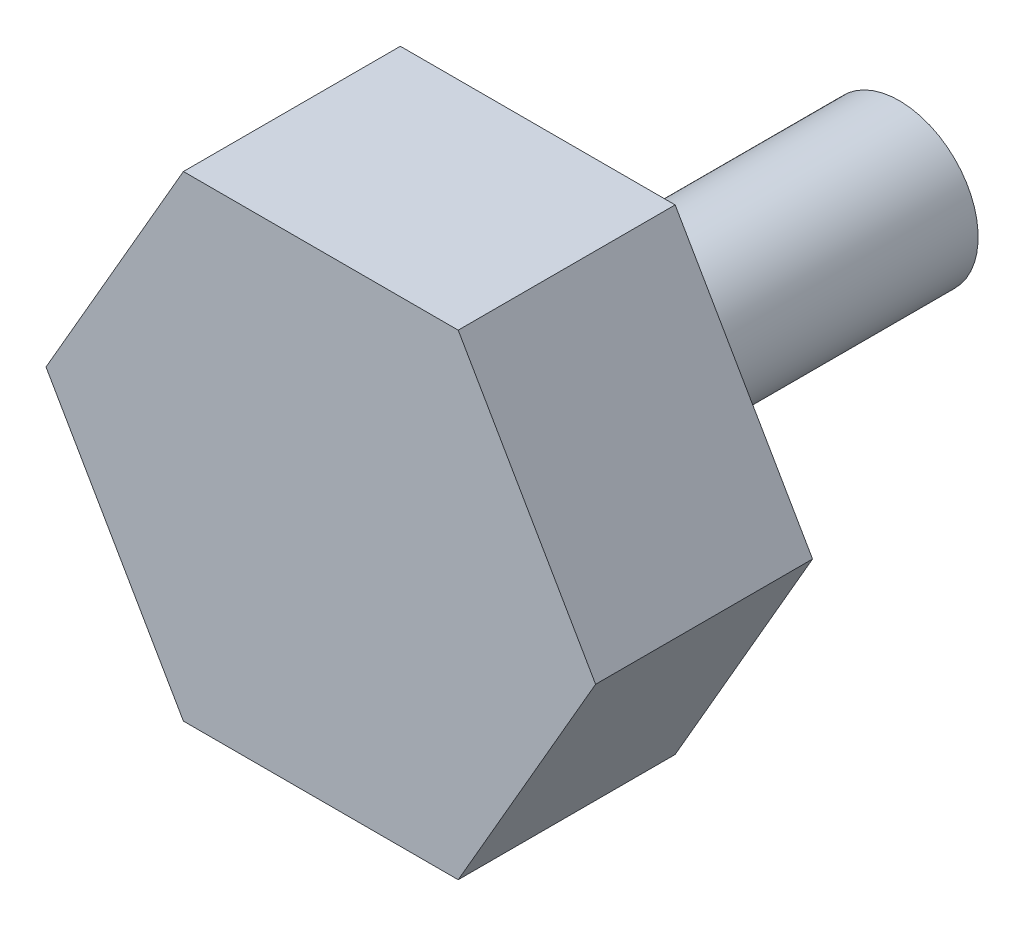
ISO-10303-21;
HEADER;
FILE_DESCRIPTION(('STEP AP214'),'2;1');
FILE_NAME('part.step','',(''),(''),'','','');
FILE_SCHEMA(('AUTOMOTIVE_DESIGN { 1 0 10303 214 1 1 1 1 }'));
ENDSEC;
DATA;
#1=APPLICATION_CONTEXT('core data for automotive mechanical design processes');
#2=APPLICATION_PROTOCOL_DEFINITION('international standard','automotive_design',2000,#1);
#3=PRODUCT_CONTEXT('',#1,'mechanical');
#4=PRODUCT('Part','Part','',(#3));
#5=PRODUCT_RELATED_PRODUCT_CATEGORY('part','',(#4));
#6=PRODUCT_DEFINITION_FORMATION('','',#4);
#7=PRODUCT_DEFINITION_CONTEXT('part definition',#1,'design');
#8=PRODUCT_DEFINITION('design','',#6,#7);
#9=PRODUCT_DEFINITION_SHAPE('','',#8);
#10=(LENGTH_UNIT() NAMED_UNIT(*) SI_UNIT(.MILLI.,.METRE.));
#11=(NAMED_UNIT(*) PLANE_ANGLE_UNIT() SI_UNIT($,.RADIAN.));
#12=(NAMED_UNIT(*) SI_UNIT($,.STERADIAN.) SOLID_ANGLE_UNIT());
#13=UNCERTAINTY_MEASURE_WITH_UNIT(LENGTH_MEASURE(1.E-05),#10,'distance_accuracy_value','');
#14=(GEOMETRIC_REPRESENTATION_CONTEXT(3) GLOBAL_UNCERTAINTY_ASSIGNED_CONTEXT((#13)) GLOBAL_UNIT_ASSIGNED_CONTEXT((#10,
#11,#12)) REPRESENTATION_CONTEXT('',''));
#15=CARTESIAN_POINT('',(0.,0.,0.));
#16=DIRECTION('',(0.,0.,1.));
#17=DIRECTION('',(1.,0.,0.));
#18=AXIS2_PLACEMENT_3D('',#15,#16,#17);
#19=CARTESIAN_POINT('',(-1.9,-3.29089653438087,3.));
#20=DIRECTION('',(0.,1.,0.));
#21=DIRECTION('',(0.,0.,1.));
#22=AXIS2_PLACEMENT_3D('',#19,#20,#21);
#23=PLANE('',#22);
#24=DIRECTION('',(1.,0.,0.));
#25=VECTOR('',#24,1.);
#26=CARTESIAN_POINT('',(-1.9,-3.29089653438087,0.));
#27=LINE('',#26,#25);
#28=CARTESIAN_POINT('',(-1.9,-3.29089653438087,0.));
#29=VERTEX_POINT('',#28);
#30=CARTESIAN_POINT('',(1.9,-3.29089653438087,0.));
#31=VERTEX_POINT('',#30);
#32=EDGE_CURVE('E129',#29,#31,#27,.T.);
#33=ORIENTED_EDGE('',*,*,#32,.T.);
#34=DIRECTION('',(0.,0.,-1.));
#35=VECTOR('',#34,1.);
#36=CARTESIAN_POINT('',(1.9,-3.29089653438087,3.));
#37=LINE('',#36,#35);
#38=CARTESIAN_POINT('',(1.9,-3.29089653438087,3.));
#39=VERTEX_POINT('',#38);
#40=EDGE_CURVE('E46',#39,#31,#37,.T.);
#41=ORIENTED_EDGE('',*,*,#40,.F.);
#42=DIRECTION('',(1.,0.,0.));
#43=VECTOR('',#42,1.);
#44=CARTESIAN_POINT('',(-1.9,-3.29089653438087,3.));
#45=LINE('',#44,#43);
#46=CARTESIAN_POINT('',(-1.9,-3.29089653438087,3.));
#47=VERTEX_POINT('',#46);
#48=EDGE_CURVE('E140',#47,#39,#45,.T.);
#49=ORIENTED_EDGE('',*,*,#48,.F.);
#50=DIRECTION('',(0.,0.,-1.));
#51=VECTOR('',#50,1.);
#52=CARTESIAN_POINT('',(-1.9,-3.29089653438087,3.));
#53=LINE('',#52,#51);
#54=EDGE_CURVE('E125',#47,#29,#53,.T.);
#55=ORIENTED_EDGE('',*,*,#54,.T.);
#56=EDGE_LOOP('',(#33,#41,#49,#55));
#57=FACE_BOUND('',#56,.T.);
#58=ADVANCED_FACE('F43',(#57),#23,.F.);
#59=CARTESIAN_POINT('',(1.9,-3.29089653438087,3.));
#60=DIRECTION('',(-0.866025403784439,0.5,0.));
#61=DIRECTION('',(-0.5,-0.866025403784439,0.));
#62=AXIS2_PLACEMENT_3D('',#59,#60,#61);
#63=PLANE('',#62);
#64=DIRECTION('',(0.5,0.866025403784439,0.));
#65=VECTOR('',#64,1.);
#66=CARTESIAN_POINT('',(1.9,-3.29089653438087,0.));
#67=LINE('',#66,#65);
#68=CARTESIAN_POINT('',(3.8,0.,0.));
#69=VERTEX_POINT('',#68);
#70=EDGE_CURVE('E132',#31,#69,#67,.T.);
#71=ORIENTED_EDGE('',*,*,#70,.T.);
#72=DIRECTION('',(0.,0.,-1.));
#73=VECTOR('',#72,1.);
#74=CARTESIAN_POINT('',(3.8,0.,3.));
#75=LINE('',#74,#73);
#76=CARTESIAN_POINT('',(3.8,0.,3.));
#77=VERTEX_POINT('',#76);
#78=EDGE_CURVE('E143',#77,#69,#75,.T.);
#79=ORIENTED_EDGE('',*,*,#78,.F.);
#80=DIRECTION('',(0.5,0.866025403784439,0.));
#81=VECTOR('',#80,1.);
#82=CARTESIAN_POINT('',(1.9,-3.29089653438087,3.));
#83=LINE('',#82,#81);
#84=EDGE_CURVE('E98',#39,#77,#83,.T.);
#85=ORIENTED_EDGE('',*,*,#84,.F.);
#86=ORIENTED_EDGE('',*,*,#40,.T.);
#87=EDGE_LOOP('',(#71,#79,#85,#86));
#88=FACE_BOUND('',#87,.T.);
#89=ADVANCED_FACE('F148',(#88),#63,.F.);
#90=CARTESIAN_POINT('',(3.8,0.,3.));
#91=DIRECTION('',(-0.866025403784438,-0.5,0.));
#92=DIRECTION('',(0.5,-0.866025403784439,0.));
#93=AXIS2_PLACEMENT_3D('',#90,#91,#92);
#94=PLANE('',#93);
#95=DIRECTION('',(-0.5,0.866025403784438,0.));
#96=VECTOR('',#95,1.);
#97=CARTESIAN_POINT('',(3.8,0.,0.));
#98=LINE('',#97,#96);
#99=CARTESIAN_POINT('',(1.9,3.29089653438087,0.));
#100=VERTEX_POINT('',#99);
#101=EDGE_CURVE('E135',#69,#100,#98,.T.);
#102=ORIENTED_EDGE('',*,*,#101,.T.);
#103=DIRECTION('',(0.,0.,-1.));
#104=VECTOR('',#103,1.);
#105=CARTESIAN_POINT('',(1.9,3.29089653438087,3.));
#106=LINE('',#105,#104);
#107=CARTESIAN_POINT('',(1.9,3.29089653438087,3.));
#108=VERTEX_POINT('',#107);
#109=EDGE_CURVE('E120',#108,#100,#106,.T.);
#110=ORIENTED_EDGE('',*,*,#109,.F.);
#111=DIRECTION('',(-0.5,0.866025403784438,0.));
#112=VECTOR('',#111,1.);
#113=CARTESIAN_POINT('',(3.8,0.,3.));
#114=LINE('',#113,#112);
#115=EDGE_CURVE('E111',#77,#108,#114,.T.);
#116=ORIENTED_EDGE('',*,*,#115,.F.);
#117=ORIENTED_EDGE('',*,*,#78,.T.);
#118=EDGE_LOOP('',(#102,#110,#116,#117));
#119=FACE_BOUND('',#118,.T.);
#120=ADVANCED_FACE('F154',(#119),#94,.F.);
#121=CARTESIAN_POINT('',(1.9,3.29089653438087,3.));
#122=DIRECTION('',(0.,-1.,0.));
#123=DIRECTION('',(1.,0.,0.));
#124=AXIS2_PLACEMENT_3D('',#121,#122,#123);
#125=PLANE('',#124);
#126=DIRECTION('',(-1.,0.,0.));
#127=VECTOR('',#126,1.);
#128=CARTESIAN_POINT('',(1.9,3.29089653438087,0.));
#129=LINE('',#128,#127);
#130=CARTESIAN_POINT('',(-1.9,3.29089653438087,0.));
#131=VERTEX_POINT('',#130);
#132=EDGE_CURVE('E119',#100,#131,#129,.T.);
#133=ORIENTED_EDGE('',*,*,#132,.T.);
#134=DIRECTION('',(0.,0.,-1.));
#135=VECTOR('',#134,1.);
#136=CARTESIAN_POINT('',(-1.9,3.29089653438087,3.));
#137=LINE('',#136,#135);
#138=CARTESIAN_POINT('',(-1.9,3.29089653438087,3.));
#139=VERTEX_POINT('',#138);
#140=EDGE_CURVE('E116',#139,#131,#137,.T.);
#141=ORIENTED_EDGE('',*,*,#140,.F.);
#142=DIRECTION('',(-1.,0.,0.));
#143=VECTOR('',#142,1.);
#144=CARTESIAN_POINT('',(1.9,3.29089653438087,3.));
#145=LINE('',#144,#143);
#146=EDGE_CURVE('E105',#108,#139,#145,.T.);
#147=ORIENTED_EDGE('',*,*,#146,.F.);
#148=ORIENTED_EDGE('',*,*,#109,.T.);
#149=EDGE_LOOP('',(#133,#141,#147,#148));
#150=FACE_BOUND('',#149,.T.);
#151=ADVANCED_FACE('F117',(#150),#125,.F.);
#152=CARTESIAN_POINT('',(-1.9,3.29089653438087,3.));
#153=DIRECTION('',(0.866025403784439,-0.5,0.));
#154=DIRECTION('',(0.5,0.866025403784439,0.));
#155=AXIS2_PLACEMENT_3D('',#152,#153,#154);
#156=PLANE('',#155);
#157=DIRECTION('',(-0.5,-0.866025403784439,0.));
#158=VECTOR('',#157,1.);
#159=CARTESIAN_POINT('',(-1.9,3.29089653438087,0.));
#160=LINE('',#159,#158);
#161=CARTESIAN_POINT('',(-3.8,0.,0.));
#162=VERTEX_POINT('',#161);
#163=EDGE_CURVE('E83',#131,#162,#160,.T.);
#164=ORIENTED_EDGE('',*,*,#163,.T.);
#165=DIRECTION('',(0.,0.,-1.));
#166=VECTOR('',#165,1.);
#167=CARTESIAN_POINT('',(-3.8,0.,3.));
#168=LINE('',#167,#166);
#169=CARTESIAN_POINT('',(-3.8,0.,3.));
#170=VERTEX_POINT('',#169);
#171=EDGE_CURVE('E121',#170,#162,#168,.T.);
#172=ORIENTED_EDGE('',*,*,#171,.F.);
#173=DIRECTION('',(-0.5,-0.866025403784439,0.));
#174=VECTOR('',#173,1.);
#175=CARTESIAN_POINT('',(-1.9,3.29089653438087,3.));
#176=LINE('',#175,#174);
#177=EDGE_CURVE('E109',#139,#170,#176,.T.);
#178=ORIENTED_EDGE('',*,*,#177,.F.);
#179=ORIENTED_EDGE('',*,*,#140,.T.);
#180=EDGE_LOOP('',(#164,#172,#178,#179));
#181=FACE_BOUND('',#180,.T.);
#182=ADVANCED_FACE('F123',(#181),#156,.F.);
#183=CARTESIAN_POINT('',(-3.8,0.,3.));
#184=DIRECTION('',(0.866025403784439,0.5,0.));
#185=DIRECTION('',(-0.5,0.866025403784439,0.));
#186=AXIS2_PLACEMENT_3D('',#183,#184,#185);
#187=PLANE('',#186);
#188=DIRECTION('',(0.5,-0.866025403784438,0.));
#189=VECTOR('',#188,1.);
#190=CARTESIAN_POINT('',(-3.8,0.,0.));
#191=LINE('',#190,#189);
#192=EDGE_CURVE('E89',#162,#29,#191,.T.);
#193=ORIENTED_EDGE('',*,*,#192,.T.);
#194=ORIENTED_EDGE('',*,*,#54,.F.);
#195=DIRECTION('',(0.5,-0.866025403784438,0.));
#196=VECTOR('',#195,1.);
#197=CARTESIAN_POINT('',(-3.8,0.,3.));
#198=LINE('',#197,#196);
#199=EDGE_CURVE('E60',#170,#47,#198,.T.);
#200=ORIENTED_EDGE('',*,*,#199,.F.);
#201=ORIENTED_EDGE('',*,*,#171,.T.);
#202=EDGE_LOOP('',(#193,#194,#200,#201));
#203=FACE_BOUND('',#202,.T.);
#204=ADVANCED_FACE('F174',(#203),#187,.F.);
#205=CARTESIAN_POINT('',(0.,0.,3.));
#206=DIRECTION('',(0.,0.,1.));
#207=DIRECTION('',(1.,0.,0.));
#208=AXIS2_PLACEMENT_3D('',#205,#206,#207);
#209=PLANE('',#208);
#210=ORIENTED_EDGE('',*,*,#48,.T.);
#211=ORIENTED_EDGE('',*,*,#84,.T.);
#212=ORIENTED_EDGE('',*,*,#115,.T.);
#213=ORIENTED_EDGE('',*,*,#146,.T.);
#214=ORIENTED_EDGE('',*,*,#177,.T.);
#215=ORIENTED_EDGE('',*,*,#199,.T.);
#216=EDGE_LOOP('',(#210,#211,#212,#213,#214,#215));
#217=FACE_BOUND('',#216,.T.);
#218=ADVANCED_FACE('F107',(#217),#209,.T.);
#219=CARTESIAN_POINT('',(0.,0.,0.));
#220=DIRECTION('',(0.,0.,1.));
#221=DIRECTION('',(1.,0.,0.));
#222=AXIS2_PLACEMENT_3D('',#219,#220,#221);
#223=PLANE('',#222);
#224=CARTESIAN_POINT('',(0.,0.,0.));
#225=DIRECTION('',(0.,0.,-1.));
#226=DIRECTION('',(-1.,0.,0.));
#227=AXIS2_PLACEMENT_3D('',#224,#225,#226);
#228=CIRCLE('',#227,1.09);
#229=CARTESIAN_POINT('',(-1.09,0.,0.));
#230=VERTEX_POINT('',#229);
#231=EDGE_CURVE('E11',#230,#230,#228,.T.);
#232=ORIENTED_EDGE('',*,*,#231,.F.);
#233=EDGE_LOOP('',(#232));
#234=FACE_BOUND('',#233,.T.);
#235=ORIENTED_EDGE('',*,*,#32,.F.);
#236=ORIENTED_EDGE('',*,*,#192,.F.);
#237=ORIENTED_EDGE('',*,*,#163,.F.);
#238=ORIENTED_EDGE('',*,*,#132,.F.);
#239=ORIENTED_EDGE('',*,*,#101,.F.);
#240=ORIENTED_EDGE('',*,*,#70,.F.);
#241=EDGE_LOOP('',(#235,#236,#237,#238,#239,#240));
#242=FACE_BOUND('',#241,.T.);
#243=ADVANCED_FACE('F153',(#234,#242),#223,.F.);
#244=CARTESIAN_POINT('',(0.,0.,-5.));
#245=DIRECTION('',(0.,0.,1.));
#246=DIRECTION('',(1.,0.,0.));
#247=AXIS2_PLACEMENT_3D('',#244,#245,#246);
#248=CYLINDRICAL_SURFACE('',#247,1.09);
#249=CARTESIAN_POINT('',(0.,0.,-5.));
#250=DIRECTION('',(0.,0.,-1.));
#251=DIRECTION('',(-1.,0.,0.));
#252=AXIS2_PLACEMENT_3D('',#249,#250,#251);
#253=CIRCLE('',#252,1.09);
#254=CARTESIAN_POINT('',(-1.09,0.,-5.));
#255=VERTEX_POINT('',#254);
#256=EDGE_CURVE('E133',#255,#255,#253,.T.);
#257=ORIENTED_EDGE('',*,*,#256,.F.);
#258=EDGE_LOOP('',(#257));
#259=FACE_BOUND('',#258,.T.);
#260=ORIENTED_EDGE('',*,*,#231,.T.);
#261=EDGE_LOOP('',(#260));
#262=FACE_BOUND('',#261,.T.);
#263=ADVANCED_FACE('F163',(#259,#262),#248,.T.);
#264=CARTESIAN_POINT('',(0.,0.,-5.));
#265=DIRECTION('',(0.,0.,-1.));
#266=DIRECTION('',(-1.,0.,0.));
#267=AXIS2_PLACEMENT_3D('',#264,#265,#266);
#268=PLANE('',#267);
#269=ORIENTED_EDGE('',*,*,#256,.T.);
#270=EDGE_LOOP('',(#269));
#271=FACE_BOUND('',#270,.T.);
#272=ADVANCED_FACE('F161',(#271),#268,.T.);
#273=CLOSED_SHELL('',(#58,#89,#120,#151,#182,#204,#218,#243,#263,#272));
#274=MANIFOLD_SOLID_BREP('B2',#273);
#275=ADVANCED_BREP_SHAPE_REPRESENTATION('',(#18,#274),#14);
#276=SHAPE_DEFINITION_REPRESENTATION(#9,#275);
ENDSEC;
END-ISO-10303-21;
